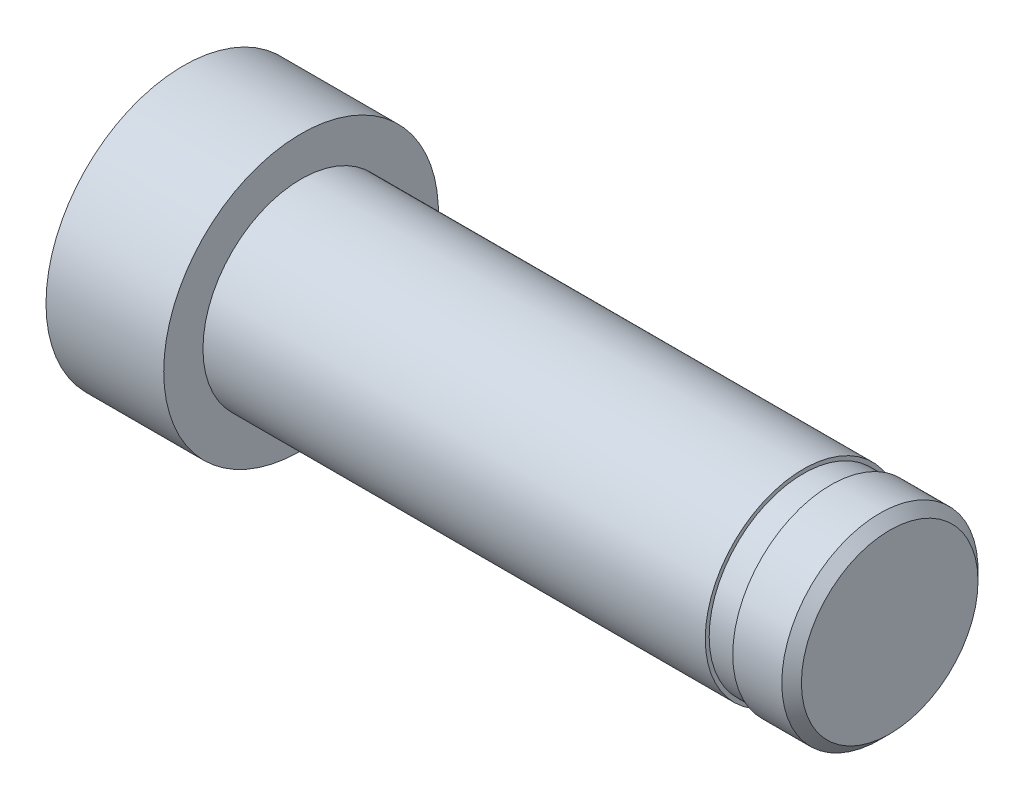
ISO-10303-21;
HEADER;
FILE_DESCRIPTION(('STEP AP214'),'2;1');
FILE_NAME('part.step','',(''),(''),'','','');
FILE_SCHEMA(('AUTOMOTIVE_DESIGN { 1 0 10303 214 1 1 1 1 }'));
ENDSEC;
DATA;
#1=APPLICATION_CONTEXT('core data for automotive mechanical design processes');
#2=APPLICATION_PROTOCOL_DEFINITION('international standard','automotive_design',2000,#1);
#3=PRODUCT_CONTEXT('',#1,'mechanical');
#4=PRODUCT('Part','Part','',(#3));
#5=PRODUCT_RELATED_PRODUCT_CATEGORY('part','',(#4));
#6=PRODUCT_DEFINITION_FORMATION('','',#4);
#7=PRODUCT_DEFINITION_CONTEXT('part definition',#1,'design');
#8=PRODUCT_DEFINITION('design','',#6,#7);
#9=PRODUCT_DEFINITION_SHAPE('','',#8);
#10=(LENGTH_UNIT() NAMED_UNIT(*) SI_UNIT(.MILLI.,.METRE.));
#11=(NAMED_UNIT(*) PLANE_ANGLE_UNIT() SI_UNIT($,.RADIAN.));
#12=(NAMED_UNIT(*) SI_UNIT($,.STERADIAN.) SOLID_ANGLE_UNIT());
#13=UNCERTAINTY_MEASURE_WITH_UNIT(LENGTH_MEASURE(1.E-05),#10,'distance_accuracy_value','');
#14=(GEOMETRIC_REPRESENTATION_CONTEXT(3) GLOBAL_UNCERTAINTY_ASSIGNED_CONTEXT((#13)) GLOBAL_UNIT_ASSIGNED_CONTEXT((#10,
#11,#12)) REPRESENTATION_CONTEXT('',''));
#15=CARTESIAN_POINT('',(0.,0.,0.));
#16=DIRECTION('',(0.,0.,1.));
#17=DIRECTION('',(1.,0.,0.));
#18=AXIS2_PLACEMENT_3D('',#15,#16,#17);
#19=CARTESIAN_POINT('',(0.,0.,0.));
#20=DIRECTION('',(1.,0.,0.));
#21=DIRECTION('',(0.,0.,-1.));
#22=AXIS2_PLACEMENT_3D('',#19,#20,#21);
#23=PLANE('',#22);
#24=CARTESIAN_POINT('',(0.,0.,0.));
#25=DIRECTION('',(-1.,0.,0.));
#26=DIRECTION('',(0.,0.,1.));
#27=AXIS2_PLACEMENT_3D('',#24,#25,#26);
#28=CIRCLE('',#27,3.5);
#29=CARTESIAN_POINT('',(0.,0.,3.5));
#30=VERTEX_POINT('',#29);
#31=EDGE_CURVE('E10',#30,#30,#28,.T.);
#32=ORIENTED_EDGE('',*,*,#31,.T.);
#33=EDGE_LOOP('',(#32));
#34=FACE_BOUND('',#33,.T.);
#35=ADVANCED_FACE('F348',(#34),#23,.F.);
#36=CARTESIAN_POINT('',(-4.,0.,0.));
#37=DIRECTION('',(-1.,0.,0.));
#38=DIRECTION('',(0.,0.,1.));
#39=AXIS2_PLACEMENT_3D('',#36,#37,#38);
#40=CYLINDRICAL_SURFACE('',#39,3.5);
#41=ORIENTED_EDGE('',*,*,#31,.F.);
#42=EDGE_LOOP('',(#41));
#43=FACE_BOUND('',#42,.T.);
#44=CARTESIAN_POINT('',(3.,0.,0.));
#45=DIRECTION('',(-1.,0.,0.));
#46=DIRECTION('',(0.,0.,1.));
#47=AXIS2_PLACEMENT_3D('',#44,#45,#46);
#48=CIRCLE('',#47,3.5);
#49=CARTESIAN_POINT('',(3.,0.,3.5));
#50=VERTEX_POINT('',#49);
#51=EDGE_CURVE('E354',#50,#50,#48,.T.);
#52=ORIENTED_EDGE('',*,*,#51,.T.);
#53=EDGE_LOOP('',(#52));
#54=FACE_BOUND('',#53,.T.);
#55=ADVANCED_FACE('F395',(#43,#54),#40,.T.);
#56=CARTESIAN_POINT('',(3.,3.5,0.));
#57=DIRECTION('',(-1.,0.,0.));
#58=DIRECTION('',(0.,0.,1.));
#59=AXIS2_PLACEMENT_3D('',#56,#57,#58);
#60=PLANE('',#59);
#61=ORIENTED_EDGE('',*,*,#51,.F.);
#62=EDGE_LOOP('',(#61));
#63=FACE_BOUND('',#62,.T.);
#64=CARTESIAN_POINT('',(3.,0.,0.));
#65=DIRECTION('',(-1.,0.,0.));
#66=DIRECTION('',(0.,0.,1.));
#67=AXIS2_PLACEMENT_3D('',#64,#65,#66);
#68=CIRCLE('',#67,2.5);
#69=CARTESIAN_POINT('',(3.,0.,2.5));
#70=VERTEX_POINT('',#69);
#71=EDGE_CURVE('E358',#70,#70,#68,.T.);
#72=ORIENTED_EDGE('',*,*,#71,.T.);
#73=EDGE_LOOP('',(#72));
#74=FACE_BOUND('',#73,.T.);
#75=ADVANCED_FACE('F399',(#63,#74),#60,.F.);
#76=CARTESIAN_POINT('',(-4.,0.,0.));
#77=DIRECTION('',(-1.,0.,0.));
#78=DIRECTION('',(0.,0.,1.));
#79=AXIS2_PLACEMENT_3D('',#76,#77,#78);
#80=CYLINDRICAL_SURFACE('',#79,2.5);
#81=ORIENTED_EDGE('',*,*,#71,.F.);
#82=EDGE_LOOP('',(#81));
#83=FACE_BOUND('',#82,.T.);
#84=CARTESIAN_POINT('',(15.8,0.,0.));
#85=DIRECTION('',(-1.,0.,0.));
#86=DIRECTION('',(0.,0.,1.));
#87=AXIS2_PLACEMENT_3D('',#84,#85,#86);
#88=CIRCLE('',#87,2.5);
#89=CARTESIAN_POINT('',(15.8,0.,2.5));
#90=VERTEX_POINT('',#89);
#91=EDGE_CURVE('E362',#90,#90,#88,.T.);
#92=ORIENTED_EDGE('',*,*,#91,.T.);
#93=EDGE_LOOP('',(#92));
#94=FACE_BOUND('',#93,.T.);
#95=ADVANCED_FACE('F404',(#83,#94),#80,.T.);
#96=CARTESIAN_POINT('',(15.8,2.5,0.));
#97=DIRECTION('',(-1.,0.,0.));
#98=DIRECTION('',(0.,0.,1.));
#99=AXIS2_PLACEMENT_3D('',#96,#97,#98);
#100=PLANE('',#99);
#101=ORIENTED_EDGE('',*,*,#91,.F.);
#102=EDGE_LOOP('',(#101));
#103=FACE_BOUND('',#102,.T.);
#104=CARTESIAN_POINT('',(15.8,0.,0.));
#105=DIRECTION('',(-1.,0.,0.));
#106=DIRECTION('',(0.,0.,1.));
#107=AXIS2_PLACEMENT_3D('',#104,#105,#106);
#108=CIRCLE('',#107,2.4);
#109=CARTESIAN_POINT('',(15.8,0.,2.4));
#110=VERTEX_POINT('',#109);
#111=EDGE_CURVE('E367',#110,#110,#108,.T.);
#112=ORIENTED_EDGE('',*,*,#111,.T.);
#113=EDGE_LOOP('',(#112));
#114=FACE_BOUND('',#113,.T.);
#115=ADVANCED_FACE('F410',(#103,#114),#100,.F.);
#116=CARTESIAN_POINT('',(-4.,0.,0.));
#117=DIRECTION('',(-1.,0.,0.));
#118=DIRECTION('',(0.,0.,1.));
#119=AXIS2_PLACEMENT_3D('',#116,#117,#118);
#120=CYLINDRICAL_SURFACE('',#119,2.4);
#121=ORIENTED_EDGE('',*,*,#111,.F.);
#122=EDGE_LOOP('',(#121));
#123=FACE_BOUND('',#122,.T.);
#124=CARTESIAN_POINT('',(16.5,0.,0.));
#125=DIRECTION('',(-1.,0.,0.));
#126=DIRECTION('',(0.,0.,1.));
#127=AXIS2_PLACEMENT_3D('',#124,#125,#126);
#128=CIRCLE('',#127,2.4);
#129=CARTESIAN_POINT('',(16.5,0.,2.4));
#130=VERTEX_POINT('',#129);
#131=EDGE_CURVE('E370',#130,#130,#128,.T.);
#132=ORIENTED_EDGE('',*,*,#131,.T.);
#133=EDGE_LOOP('',(#132));
#134=FACE_BOUND('',#133,.T.);
#135=ADVANCED_FACE('F414',(#123,#134),#120,.T.);
#136=CARTESIAN_POINT('',(16.5,2.4,0.));
#137=DIRECTION('',(1.,0.,0.));
#138=DIRECTION('',(0.,0.,-1.));
#139=AXIS2_PLACEMENT_3D('',#136,#137,#138);
#140=PLANE('',#139);
#141=ORIENTED_EDGE('',*,*,#131,.F.);
#142=EDGE_LOOP('',(#141));
#143=FACE_BOUND('',#142,.T.);
#144=CARTESIAN_POINT('',(16.5,0.,0.));
#145=DIRECTION('',(-1.,0.,0.));
#146=DIRECTION('',(0.,0.,1.));
#147=AXIS2_PLACEMENT_3D('',#144,#145,#146);
#148=CIRCLE('',#147,2.5);
#149=CARTESIAN_POINT('',(16.5,0.,2.5));
#150=VERTEX_POINT('',#149);
#151=EDGE_CURVE('E373',#150,#150,#148,.T.);
#152=ORIENTED_EDGE('',*,*,#151,.T.);
#153=EDGE_LOOP('',(#152));
#154=FACE_BOUND('',#153,.T.);
#155=ADVANCED_FACE('F418',(#143,#154),#140,.F.);
#156=CARTESIAN_POINT('',(-4.,0.,0.));
#157=DIRECTION('',(-1.,0.,0.));
#158=DIRECTION('',(0.,0.,1.));
#159=AXIS2_PLACEMENT_3D('',#156,#157,#158);
#160=CYLINDRICAL_SURFACE('',#159,2.5);
#161=ORIENTED_EDGE('',*,*,#151,.F.);
#162=EDGE_LOOP('',(#161));
#163=FACE_BOUND('',#162,.T.);
#164=CARTESIAN_POINT('',(17.75,0.,0.));
#165=DIRECTION('',(-1.,0.,0.));
#166=DIRECTION('',(0.,0.,1.));
#167=AXIS2_PLACEMENT_3D('',#164,#165,#166);
#168=CIRCLE('',#167,2.5);
#169=CARTESIAN_POINT('',(17.75,0.,2.5));
#170=VERTEX_POINT('',#169);
#171=EDGE_CURVE('E376',#170,#170,#168,.T.);
#172=ORIENTED_EDGE('',*,*,#171,.T.);
#173=EDGE_LOOP('',(#172));
#174=FACE_BOUND('',#173,.T.);
#175=ADVANCED_FACE('F391',(#163,#174),#160,.T.);
#176=CARTESIAN_POINT('',(18.,0.,0.));
#177=DIRECTION('',(-1.,0.,0.));
#178=DIRECTION('',(0.,0.,1.));
#179=AXIS2_PLACEMENT_3D('',#176,#177,#178);
#180=CONICAL_SURFACE('',#179,2.25,0.785398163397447);
#181=ORIENTED_EDGE('',*,*,#171,.F.);
#182=EDGE_LOOP('',(#181));
#183=FACE_BOUND('',#182,.T.);
#184=CARTESIAN_POINT('',(18.,0.,0.));
#185=DIRECTION('',(-1.,0.,0.));
#186=DIRECTION('',(0.,0.,1.));
#187=AXIS2_PLACEMENT_3D('',#184,#185,#186);
#188=CIRCLE('',#187,2.25);
#189=CARTESIAN_POINT('',(18.,0.,2.25));
#190=VERTEX_POINT('',#189);
#191=EDGE_CURVE('E379',#190,#190,#188,.T.);
#192=ORIENTED_EDGE('',*,*,#191,.T.);
#193=EDGE_LOOP('',(#192));
#194=FACE_BOUND('',#193,.T.);
#195=ADVANCED_FACE('F383',(#183,#194),#180,.T.);
#196=CARTESIAN_POINT('',(18.,2.25,0.));
#197=DIRECTION('',(-1.,0.,0.));
#198=DIRECTION('',(0.,0.,1.));
#199=AXIS2_PLACEMENT_3D('',#196,#197,#198);
#200=PLANE('',#199);
#201=ORIENTED_EDGE('',*,*,#191,.F.);
#202=EDGE_LOOP('',(#201));
#203=FACE_BOUND('',#202,.T.);
#204=ADVANCED_FACE('F385',(#203),#200,.F.);
#205=CLOSED_SHELL('',(#35,#55,#75,#95,#115,#135,#155,#175,#195,#204));
#206=MANIFOLD_SOLID_BREP('B2',#205);
#207=ADVANCED_BREP_SHAPE_REPRESENTATION('',(#18,#206),#14);
#208=SHAPE_DEFINITION_REPRESENTATION(#9,#207);
ENDSEC;
END-ISO-10303-21;
